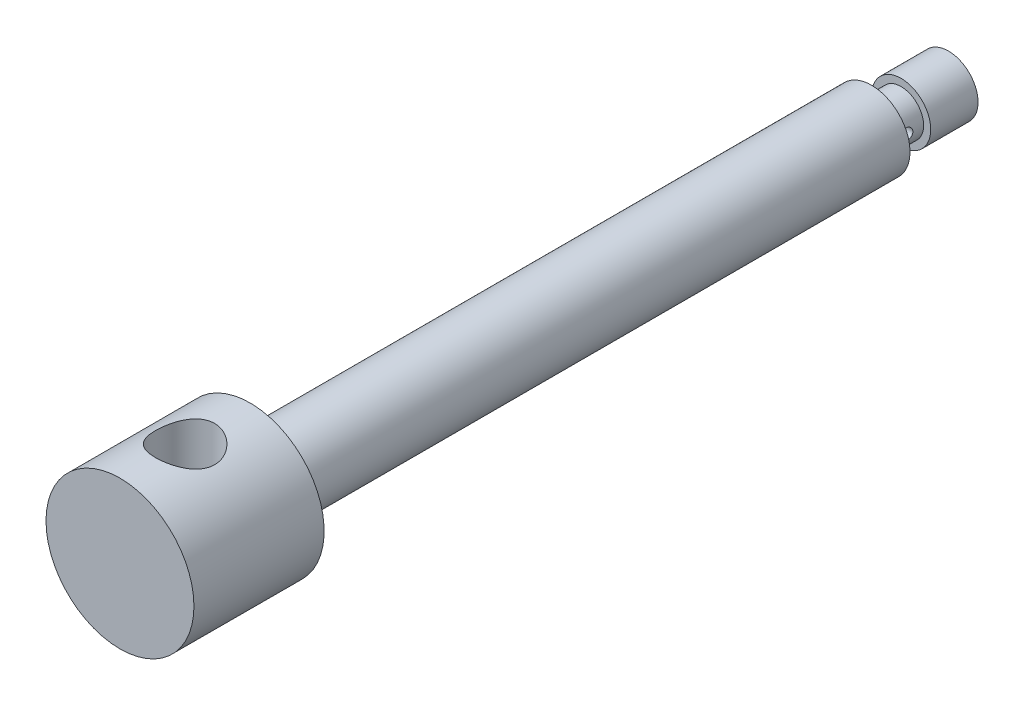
ISO-10303-21;
HEADER;
FILE_DESCRIPTION(('STEP AP214'),'2;1');
FILE_NAME('part.step','',(''),(''),'','','');
FILE_SCHEMA(('AUTOMOTIVE_DESIGN { 1 0 10303 214 1 1 1 1 }'));
ENDSEC;
DATA;
#1=APPLICATION_CONTEXT('core data for automotive mechanical design processes');
#2=APPLICATION_PROTOCOL_DEFINITION('international standard','automotive_design',2000,#1);
#3=PRODUCT_CONTEXT('',#1,'mechanical');
#4=PRODUCT('Part','Part','',(#3));
#5=PRODUCT_RELATED_PRODUCT_CATEGORY('part','',(#4));
#6=PRODUCT_DEFINITION_FORMATION('','',#4);
#7=PRODUCT_DEFINITION_CONTEXT('part definition',#1,'design');
#8=PRODUCT_DEFINITION('design','',#6,#7);
#9=PRODUCT_DEFINITION_SHAPE('','',#8);
#10=(LENGTH_UNIT() NAMED_UNIT(*) SI_UNIT(.MILLI.,.METRE.));
#11=(NAMED_UNIT(*) PLANE_ANGLE_UNIT() SI_UNIT($,.RADIAN.));
#12=(NAMED_UNIT(*) SI_UNIT($,.STERADIAN.) SOLID_ANGLE_UNIT());
#13=UNCERTAINTY_MEASURE_WITH_UNIT(LENGTH_MEASURE(1.E-05),#10,'distance_accuracy_value','');
#14=(GEOMETRIC_REPRESENTATION_CONTEXT(3) GLOBAL_UNCERTAINTY_ASSIGNED_CONTEXT((#13)) GLOBAL_UNIT_ASSIGNED_CONTEXT((#10,
#11,#12)) REPRESENTATION_CONTEXT('',''));
#15=CARTESIAN_POINT('',(0.,0.,0.));
#16=DIRECTION('',(0.,0.,1.));
#17=DIRECTION('',(1.,0.,0.));
#18=AXIS2_PLACEMENT_3D('',#15,#16,#17);
#19=CARTESIAN_POINT('',(0.,0.,140.));
#20=DIRECTION('',(0.,0.,-1.));
#21=DIRECTION('',(-1.,0.,0.));
#22=AXIS2_PLACEMENT_3D('',#19,#20,#21);
#23=CYLINDRICAL_SURFACE('',#22,12.5);
#24=CARTESIAN_POINT('',(0.,-12.5,134.));
#25=CARTESIAN_POINT('',(-0.134428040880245,-12.4999993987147,133.999999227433));
#26=CARTESIAN_POINT('',(-0.268907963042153,-12.4978254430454,133.994571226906));
#27=CARTESIAN_POINT('',(-0.536916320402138,-12.4891841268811,133.972908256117));
#28=CARTESIAN_POINT('',(-0.670444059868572,-12.482713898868,133.956666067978));
#29=CARTESIAN_POINT('',(-0.935792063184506,-12.4656328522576,133.913491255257));
#30=CARTESIAN_POINT('',(-1.06760803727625,-12.45501315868,133.886535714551));
#31=CARTESIAN_POINT('',(-1.32834211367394,-12.4299104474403,133.822193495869));
#32=CARTESIAN_POINT('',(-1.45725900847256,-12.4154258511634,133.78480255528));
#33=CARTESIAN_POINT('',(-1.71081101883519,-12.3830283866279,133.700097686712));
#34=CARTESIAN_POINT('',(-1.83546024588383,-12.3651284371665,133.652821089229));
#35=CARTESIAN_POINT('',(-2.08021423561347,-12.3263173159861,133.548672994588));
#36=CARTESIAN_POINT('',(-2.20031728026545,-12.3054050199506,133.491797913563));
#37=CARTESIAN_POINT('',(-2.5525365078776,-12.2389309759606,133.307506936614));
#38=CARTESIAN_POINT('',(-2.77691477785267,-12.1895849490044,133.166306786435));
#39=CARTESIAN_POINT('',(-3.20878788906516,-12.0832695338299,132.844405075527));
#40=CARTESIAN_POINT('',(-3.41514420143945,-12.0260638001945,132.662267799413));
#41=CARTESIAN_POINT('',(-3.79544899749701,-11.9115080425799,132.266465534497));
#42=CARTESIAN_POINT('',(-3.96938162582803,-11.8541579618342,132.052785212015));
#43=CARTESIAN_POINT('',(-4.20603567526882,-11.7714356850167,131.707393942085));
#44=CARTESIAN_POINT('',(-4.28222203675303,-11.7438622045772,131.585220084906));
#45=CARTESIAN_POINT('',(-4.42396507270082,-11.6912035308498,131.334363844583));
#46=CARTESIAN_POINT('',(-4.4895261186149,-11.6661173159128,131.205684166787));
#47=CARTESIAN_POINT('',(-4.60945924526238,-11.6192528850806,130.942624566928));
#48=CARTESIAN_POINT('',(-4.66383056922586,-11.5974748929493,130.808244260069));
#49=CARTESIAN_POINT('',(-4.76082403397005,-11.5579971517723,130.534791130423));
#50=CARTESIAN_POINT('',(-4.80345206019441,-11.5402953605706,130.39572069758));
#51=CARTESIAN_POINT('',(-4.87487504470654,-11.5103008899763,130.120233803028));
#52=CARTESIAN_POINT('',(-4.90420529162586,-11.4978009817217,129.983978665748));
#53=CARTESIAN_POINT('',(-4.95140857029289,-11.4775526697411,129.709206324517));
#54=CARTESIAN_POINT('',(-4.96928677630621,-11.4698021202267,129.570690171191));
#55=CARTESIAN_POINT('',(-4.99338985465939,-11.4593294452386,129.292486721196));
#56=CARTESIAN_POINT('',(-4.99961718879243,-11.4566062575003,129.152799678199));
#57=CARTESIAN_POINT('',(-5.0003485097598,-11.4562871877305,128.873392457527));
#58=CARTESIAN_POINT('',(-4.99485304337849,-11.4586910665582,128.7336722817));
#59=CARTESIAN_POINT('',(-4.97300139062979,-11.4681900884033,128.465095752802));
#60=CARTESIAN_POINT('',(-4.95743098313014,-11.4749456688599,128.33616251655));
#61=CARTESIAN_POINT('',(-4.91636669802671,-11.4925992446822,128.080133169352));
#62=CARTESIAN_POINT('',(-4.89086955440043,-11.5034986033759,127.953037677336));
#63=CARTESIAN_POINT('',(-4.83020381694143,-11.5291029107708,127.701598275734));
#64=CARTESIAN_POINT('',(-4.79503755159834,-11.5438069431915,127.577253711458));
#65=CARTESIAN_POINT('',(-4.71535272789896,-11.5765839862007,127.332038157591));
#66=CARTESIAN_POINT('',(-4.67083057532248,-11.5946582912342,127.211168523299));
#67=CARTESIAN_POINT('',(-4.52178156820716,-11.6539749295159,126.850100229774));
#68=CARTESIAN_POINT('',(-4.40296429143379,-11.6997808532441,126.616367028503));
#69=CARTESIAN_POINT('',(-4.13125151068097,-11.7984565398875,126.171420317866));
#70=CARTESIAN_POINT('',(-3.97834320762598,-11.851328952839,125.960215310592));
#71=CARTESIAN_POINT('',(-3.62889137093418,-11.9631659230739,125.548992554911));
#72=CARTESIAN_POINT('',(-3.42988845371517,-12.0222854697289,125.351101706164));
#73=CARTESIAN_POINT('',(-3.0007412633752,-12.1365017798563,124.990765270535));
#74=CARTESIAN_POINT('',(-2.77059080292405,-12.1915977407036,124.828326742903));
#75=CARTESIAN_POINT('',(-2.40397180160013,-12.2673153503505,124.613475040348));
#76=CARTESIAN_POINT('',(-2.2767950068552,-12.2916102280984,124.546127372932));
#77=CARTESIAN_POINT('',(-2.01664956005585,-12.3369572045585,124.422464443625));
#78=CARTESIAN_POINT('',(-1.88368330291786,-12.3580106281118,124.366144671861));
#79=CARTESIAN_POINT('',(-1.61291597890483,-12.3962575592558,124.265088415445));
#80=CARTESIAN_POINT('',(-1.47511586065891,-12.4134518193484,124.220349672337));
#81=CARTESIAN_POINT('',(-1.19570710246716,-12.4434728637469,124.142913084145));
#82=CARTESIAN_POINT('',(-1.05409872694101,-12.4562999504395,124.110214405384));
#83=CARTESIAN_POINT('',(-0.776729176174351,-12.4765727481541,124.058806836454));
#84=CARTESIAN_POINT('',(-0.641120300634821,-12.4842928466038,124.039382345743));
#85=CARTESIAN_POINT('',(-0.368536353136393,-12.4953107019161,124.011718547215));
#86=CARTESIAN_POINT('',(-0.231560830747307,-12.4986069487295,124.00348305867));
#87=CARTESIAN_POINT('',(0.0425534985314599,-12.5006785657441,123.998303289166));
#88=CARTESIAN_POINT('',(0.179692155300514,-12.4994566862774,124.001352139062));
#89=CARTESIAN_POINT('',(0.453193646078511,-12.4925311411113,124.018695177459));
#90=CARTESIAN_POINT('',(0.589556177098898,-12.4868258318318,124.032993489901));
#91=CARTESIAN_POINT('',(0.8542487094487,-12.4714486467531,124.071782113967));
#92=CARTESIAN_POINT('',(0.982662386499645,-12.4619685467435,124.095780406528));
#93=CARTESIAN_POINT('',(1.236951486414,-12.4393027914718,124.153665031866));
#94=CARTESIAN_POINT('',(1.36282600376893,-12.4261158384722,124.187554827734));
#95=CARTESIAN_POINT('',(1.61115102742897,-12.396363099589,124.26490828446));
#96=CARTESIAN_POINT('',(1.73360251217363,-12.3797982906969,124.308369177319));
#97=CARTESIAN_POINT('',(1.97439656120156,-12.3436873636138,124.404503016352));
#98=CARTESIAN_POINT('',(2.0927375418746,-12.324140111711,124.457179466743));
#99=CARTESIAN_POINT('',(2.44755555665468,-12.2604306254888,124.631907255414));
#100=CARTESIAN_POINT('',(2.67640599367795,-12.2121249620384,124.768346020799));
#101=CARTESIAN_POINT('',(3.10864805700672,-12.1093295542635,125.074868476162));
#102=CARTESIAN_POINT('',(3.31202942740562,-12.0548373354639,125.244965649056));
#103=CARTESIAN_POINT('',(3.7017918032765,-11.941130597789,125.627158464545));
#104=CARTESIAN_POINT('',(3.88616393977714,-11.8818418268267,125.841285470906));
#105=CARTESIAN_POINT('',(4.21689889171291,-11.7685360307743,126.29864859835));
#106=CARTESIAN_POINT('',(4.36325544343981,-11.7145198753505,126.541889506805));
#107=CARTESIAN_POINT('',(4.55142555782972,-11.6421255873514,126.925118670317));
#108=CARTESIAN_POINT('',(4.60914530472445,-11.6193337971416,127.05667972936));
#109=CARTESIAN_POINT('',(4.7132051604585,-11.5775147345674,127.324787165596));
#110=CARTESIAN_POINT('',(4.7595502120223,-11.5584858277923,127.461331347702));
#111=CARTESIAN_POINT('',(4.84036067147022,-11.5248785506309,127.73836312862));
#112=CARTESIAN_POINT('',(4.87483074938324,-11.5102984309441,127.878849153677));
#113=CARTESIAN_POINT('',(4.93151664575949,-11.4861263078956,128.162694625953));
#114=CARTESIAN_POINT('',(4.95373349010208,-11.4765338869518,128.306053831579));
#115=CARTESIAN_POINT('',(4.9844819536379,-11.463210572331,128.583998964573));
#116=CARTESIAN_POINT('',(4.99388565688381,-11.4591065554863,128.718471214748));
#117=CARTESIAN_POINT('',(5.00180093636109,-11.4556539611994,128.987846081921));
#118=CARTESIAN_POINT('',(5.00030885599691,-11.4563069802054,129.122748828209));
#119=CARTESIAN_POINT('',(4.98644346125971,-11.4623486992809,129.391817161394));
#120=CARTESIAN_POINT('',(4.97407559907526,-11.4677350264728,129.525983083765));
#121=CARTESIAN_POINT('',(4.93860056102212,-11.4830569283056,129.792672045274));
#122=CARTESIAN_POINT('',(4.91548933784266,-11.4929942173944,129.92519444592));
#123=CARTESIAN_POINT('',(4.8599068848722,-11.5166044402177,130.182329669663));
#124=CARTESIAN_POINT('',(4.82784722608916,-11.5301119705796,130.307046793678));
#125=CARTESIAN_POINT('',(4.75435551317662,-11.5606089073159,130.553266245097));
#126=CARTESIAN_POINT('',(4.71292020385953,-11.5775995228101,130.674767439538));
#127=CARTESIAN_POINT('',(4.57505004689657,-11.6330901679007,131.033314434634));
#128=CARTESIAN_POINT('',(4.46501084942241,-11.6761269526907,131.264587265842));
#129=CARTESIAN_POINT('',(4.20467910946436,-11.7724663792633,131.719056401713));
#130=CARTESIAN_POINT('',(4.052442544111,-11.8262157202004,131.941032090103));
#131=CARTESIAN_POINT('',(3.71470108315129,-11.9366014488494,132.357497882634));
#132=CARTESIAN_POINT('',(3.52918616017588,-11.9932387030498,132.551979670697));
#133=CARTESIAN_POINT('',(3.22271513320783,-12.0779292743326,132.825513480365));
#134=CARTESIAN_POINT('',(3.11206947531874,-12.1069791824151,132.916056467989));
#135=CARTESIAN_POINT('',(2.88318647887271,-12.1635153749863,133.08749937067));
#136=CARTESIAN_POINT('',(2.76495189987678,-12.1910022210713,133.16840276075));
#137=CARTESIAN_POINT('',(2.52148785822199,-12.2436771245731,133.32003376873));
#138=CARTESIAN_POINT('',(2.39625194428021,-12.268863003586,133.390751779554));
#139=CARTESIAN_POINT('',(2.13974317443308,-12.3161883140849,133.52130456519));
#140=CARTESIAN_POINT('',(2.00847311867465,-12.338329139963,133.581144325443));
#141=CARTESIAN_POINT('',(1.7431850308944,-12.378569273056,133.688433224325));
#142=CARTESIAN_POINT('',(1.60925996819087,-12.3967345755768,133.736087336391));
#143=CARTESIAN_POINT('',(1.33744351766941,-12.4289968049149,133.819902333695));
#144=CARTESIAN_POINT('',(1.19955402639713,-12.4430956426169,133.856068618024));
#145=CARTESIAN_POINT('',(0.921178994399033,-12.4667917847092,133.916469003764));
#146=CARTESIAN_POINT('',(0.780700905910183,-12.4764003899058,133.94073306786));
#147=CARTESIAN_POINT('',(0.498015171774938,-12.4908758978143,133.977174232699));
#148=CARTESIAN_POINT('',(0.35580891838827,-12.4957463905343,133.989360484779));
#149=CARTESIAN_POINT('',(0.177825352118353,-12.4987857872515,133.996963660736));
#150=CARTESIAN_POINT('',(0.142272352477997,-12.4992409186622,133.998102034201));
#151=CARTESIAN_POINT('',(0.0711474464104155,-12.4998481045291,133.999620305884));
#152=CARTESIAN_POINT('',(0.0355755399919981,-12.5000001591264,134.000000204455));
#153=CARTESIAN_POINT('',(0.,-12.5,134.));
#154=B_SPLINE_CURVE_WITH_KNOTS('',3,(#24,#25,#26,#27,#28,#29,#30,#31,#32,#33,#34,#35,#36,#37,
#38,#39,#40,#41,#42,#43,#44,#45,#46,#47,#48,#49,#50,#51,#52,#53,#54,#55,#56,#57,#58,#59,#60,#61,
#62,#63,#64,#65,#66,#67,#68,#69,#70,#71,#72,#73,#74,#75,#76,#77,#78,#79,#80,#81,#82,#83,#84,#85,
#86,#87,#88,#89,#90,#91,#92,#93,#94,#95,#96,#97,#98,#99,#100,#101,#102,#103,#104,#105,#106,#107,
#108,#109,#110,#111,#112,#113,#114,#115,#116,#117,#118,#119,#120,#121,#122,#123,#124,#125,#126,
#127,#128,#129,#130,#131,#132,#133,#134,#135,#136,#137,#138,#139,#140,#141,#142,#143,#144,#145,
#146,#147,#148,#149,#150,#151,#152,#153),.UNSPECIFIED.,.T.,.F.,(4,2,2,2,2,2,2,2,2,2,2,2,2,2,2,2,
2,2,2,2,2,2,2,2,2,2,2,2,2,2,2,2,2,2,2,2,2,2,2,2,2,2,2,2,2,2,2,2,2,2,2,2,2,2,2,2,2,2,2,2,2,2,2,2,
4),(0.,0.403247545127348,0.806764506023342,1.21114928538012,1.61569948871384,2.01874874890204,
2.42194883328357,3.22723902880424,4.06710473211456,4.90738006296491,5.3467199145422,
5.78587855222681,6.22506688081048,6.66403469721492,7.08328748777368,7.50235071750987,
7.92132539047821,8.34028052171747,8.72995920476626,9.119766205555,9.50947941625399,
9.89934261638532,10.6941760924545,11.4893084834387,12.3459066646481,13.2026752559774,
13.6400384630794,14.0772224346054,14.5143210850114,14.9513894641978,15.3624968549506,
15.7737445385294,16.1847419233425,16.5958900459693,16.9883780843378,17.3810037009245,
17.7735159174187,18.1661777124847,18.9747143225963,19.783575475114,20.6458383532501,
21.5082432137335,21.9441519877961,22.379871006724,22.8154184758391,23.2509294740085,
23.655003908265,24.0592139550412,24.4632214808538,24.8673813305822,25.2553678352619,
25.6434892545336,26.4191721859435,27.2392679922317,28.0596113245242,28.4968494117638,
28.9339293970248,29.3714189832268,29.8087075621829,30.2380680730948,30.667226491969,
31.0952989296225,31.5230467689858,31.6297637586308,31.7364806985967),.UNSPECIFIED.);
#155=CARTESIAN_POINT('',(0.,-12.5,134.));
#156=VERTEX_POINT('',#155);
#157=EDGE_CURVE('E94',#156,#156,#154,.T.);
#158=ORIENTED_EDGE('',*,*,#157,.F.);
#159=EDGE_LOOP('',(#158));
#160=FACE_BOUND('',#159,.T.);
#161=CARTESIAN_POINT('',(0.,12.5,124.));
#162=CARTESIAN_POINT('',(0.134428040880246,12.4999993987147,124.000000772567));
#163=CARTESIAN_POINT('',(0.268907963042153,12.4978254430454,124.005428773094));
#164=CARTESIAN_POINT('',(0.536916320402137,12.4891841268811,124.027091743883));
#165=CARTESIAN_POINT('',(0.67044405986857,12.482713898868,124.043333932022));
#166=CARTESIAN_POINT('',(0.935792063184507,12.4656328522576,124.086508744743));
#167=CARTESIAN_POINT('',(1.06760803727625,12.45501315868,124.113464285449));
#168=CARTESIAN_POINT('',(1.32834211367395,12.4299104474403,124.177806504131));
#169=CARTESIAN_POINT('',(1.45725900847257,12.4154258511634,124.21519744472));
#170=CARTESIAN_POINT('',(1.71081101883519,12.3830283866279,124.299902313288));
#171=CARTESIAN_POINT('',(1.83546024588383,12.3651284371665,124.347178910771));
#172=CARTESIAN_POINT('',(2.08021423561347,12.3263173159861,124.451327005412));
#173=CARTESIAN_POINT('',(2.20031728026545,12.3054050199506,124.508202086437));
#174=CARTESIAN_POINT('',(2.5525365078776,12.2389309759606,124.692493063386));
#175=CARTESIAN_POINT('',(2.77691477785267,12.1895849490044,124.833693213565));
#176=CARTESIAN_POINT('',(3.20878788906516,12.0832695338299,125.155594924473));
#177=CARTESIAN_POINT('',(3.41514420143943,12.0260638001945,125.337732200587));
#178=CARTESIAN_POINT('',(3.79544899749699,11.9115080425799,125.733534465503));
#179=CARTESIAN_POINT('',(3.96938162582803,11.8541579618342,125.947214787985));
#180=CARTESIAN_POINT('',(4.20603567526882,11.7714356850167,126.292606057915));
#181=CARTESIAN_POINT('',(4.28222203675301,11.7438622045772,126.414779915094));
#182=CARTESIAN_POINT('',(4.42396507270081,11.6912035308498,126.665636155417));
#183=CARTESIAN_POINT('',(4.4895261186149,11.6661173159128,126.794315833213));
#184=CARTESIAN_POINT('',(4.60945924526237,11.6192528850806,127.057375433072));
#185=CARTESIAN_POINT('',(4.66383056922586,11.5974748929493,127.191755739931));
#186=CARTESIAN_POINT('',(4.76082403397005,11.5579971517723,127.465208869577));
#187=CARTESIAN_POINT('',(4.80345206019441,11.5402953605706,127.60427930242));
#188=CARTESIAN_POINT('',(4.87487504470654,11.5103008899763,127.879766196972));
#189=CARTESIAN_POINT('',(4.90420529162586,11.4978009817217,128.016021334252));
#190=CARTESIAN_POINT('',(4.95140857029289,11.4775526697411,128.290793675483));
#191=CARTESIAN_POINT('',(4.9692867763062,11.4698021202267,128.429309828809));
#192=CARTESIAN_POINT('',(4.99338985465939,11.4593294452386,128.707513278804));
#193=CARTESIAN_POINT('',(4.99961718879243,11.4566062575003,128.847200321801));
#194=CARTESIAN_POINT('',(5.0003485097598,11.4562871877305,129.126607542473));
#195=CARTESIAN_POINT('',(4.99485304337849,11.4586910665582,129.2663277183));
#196=CARTESIAN_POINT('',(4.97300139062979,11.4681900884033,129.534904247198));
#197=CARTESIAN_POINT('',(4.95743098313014,11.4749456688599,129.66383748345));
#198=CARTESIAN_POINT('',(4.91636669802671,11.4925992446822,129.919866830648));
#199=CARTESIAN_POINT('',(4.89086955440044,11.5034986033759,130.046962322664));
#200=CARTESIAN_POINT('',(4.83020381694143,11.5291029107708,130.298401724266));
#201=CARTESIAN_POINT('',(4.79503755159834,11.5438069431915,130.422746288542));
#202=CARTESIAN_POINT('',(4.71535272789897,11.5765839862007,130.667961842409));
#203=CARTESIAN_POINT('',(4.67083057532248,11.5946582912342,130.788831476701));
#204=CARTESIAN_POINT('',(4.52178156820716,11.6539749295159,131.149899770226));
#205=CARTESIAN_POINT('',(4.40296429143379,11.6997808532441,131.383632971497));
#206=CARTESIAN_POINT('',(4.13125151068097,11.7984565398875,131.828579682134));
#207=CARTESIAN_POINT('',(3.97834320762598,11.851328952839,132.039784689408));
#208=CARTESIAN_POINT('',(3.62889137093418,11.9631659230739,132.451007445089));
#209=CARTESIAN_POINT('',(3.42988845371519,12.0222854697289,132.648898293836));
#210=CARTESIAN_POINT('',(3.00074126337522,12.1365017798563,133.009234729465));
#211=CARTESIAN_POINT('',(2.77059080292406,12.1915977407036,133.171673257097));
#212=CARTESIAN_POINT('',(2.40397180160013,12.2673153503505,133.386524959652));
#213=CARTESIAN_POINT('',(2.2767950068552,12.2916102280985,133.453872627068));
#214=CARTESIAN_POINT('',(2.01664956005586,12.3369572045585,133.577535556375));
#215=CARTESIAN_POINT('',(1.88368330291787,12.3580106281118,133.633855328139));
#216=CARTESIAN_POINT('',(1.61291597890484,12.3962575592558,133.734911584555));
#217=CARTESIAN_POINT('',(1.47511586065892,12.4134518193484,133.779650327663));
#218=CARTESIAN_POINT('',(1.19570710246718,12.4434728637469,133.857086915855));
#219=CARTESIAN_POINT('',(1.05409872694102,12.4562999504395,133.889785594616));
#220=CARTESIAN_POINT('',(0.776729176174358,12.4765727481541,133.941193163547));
#221=CARTESIAN_POINT('',(0.641120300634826,12.4842928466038,133.960617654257));
#222=CARTESIAN_POINT('',(0.368536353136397,12.4953107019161,133.988281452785));
#223=CARTESIAN_POINT('',(0.231560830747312,12.4986069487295,133.996516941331));
#224=CARTESIAN_POINT('',(-0.0425534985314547,12.5006785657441,134.001696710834));
#225=CARTESIAN_POINT('',(-0.17969215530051,12.4994566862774,133.998647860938));
#226=CARTESIAN_POINT('',(-0.453193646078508,12.4925311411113,133.981304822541));
#227=CARTESIAN_POINT('',(-0.589556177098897,12.4868258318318,133.967006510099));
#228=CARTESIAN_POINT('',(-0.854248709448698,12.4714486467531,133.928217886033));
#229=CARTESIAN_POINT('',(-0.982662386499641,12.4619685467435,133.904219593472));
#230=CARTESIAN_POINT('',(-1.236951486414,12.4393027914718,133.846334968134));
#231=CARTESIAN_POINT('',(-1.36282600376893,12.4261158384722,133.812445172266));
#232=CARTESIAN_POINT('',(-1.61115102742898,12.396363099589,133.73509171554));
#233=CARTESIAN_POINT('',(-1.73360251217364,12.3797982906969,133.691630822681));
#234=CARTESIAN_POINT('',(-1.97439656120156,12.3436873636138,133.595496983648));
#235=CARTESIAN_POINT('',(-2.0927375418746,12.324140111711,133.542820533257));
#236=CARTESIAN_POINT('',(-2.44755555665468,12.2604306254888,133.368092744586));
#237=CARTESIAN_POINT('',(-2.67640599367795,12.2121249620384,133.231653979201));
#238=CARTESIAN_POINT('',(-3.10864805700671,12.1093295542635,132.925131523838));
#239=CARTESIAN_POINT('',(-3.31202942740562,12.0548373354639,132.755034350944));
#240=CARTESIAN_POINT('',(-3.7017918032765,11.941130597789,132.372841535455));
#241=CARTESIAN_POINT('',(-3.88616393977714,11.8818418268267,132.158714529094));
#242=CARTESIAN_POINT('',(-4.21689889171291,11.7685360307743,131.70135140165));
#243=CARTESIAN_POINT('',(-4.36325544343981,11.7145198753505,131.458110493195));
#244=CARTESIAN_POINT('',(-4.55142555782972,11.6421255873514,131.074881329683));
#245=CARTESIAN_POINT('',(-4.60914530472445,11.6193337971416,130.94332027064));
#246=CARTESIAN_POINT('',(-4.7132051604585,11.5775147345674,130.675212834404));
#247=CARTESIAN_POINT('',(-4.7595502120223,11.5584858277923,130.538668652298));
#248=CARTESIAN_POINT('',(-4.84036067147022,11.5248785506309,130.26163687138));
#249=CARTESIAN_POINT('',(-4.87483074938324,11.5102984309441,130.121150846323));
#250=CARTESIAN_POINT('',(-4.93151664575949,11.4861263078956,129.837305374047));
#251=CARTESIAN_POINT('',(-4.95373349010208,11.4765338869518,129.693946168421));
#252=CARTESIAN_POINT('',(-4.9844819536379,11.463210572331,129.416001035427));
#253=CARTESIAN_POINT('',(-4.99388565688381,11.4591065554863,129.281528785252));
#254=CARTESIAN_POINT('',(-5.00180093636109,11.4556539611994,129.012153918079));
#255=CARTESIAN_POINT('',(-5.00030885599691,11.4563069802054,128.877251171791));
#256=CARTESIAN_POINT('',(-4.98644346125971,11.4623486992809,128.608182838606));
#257=CARTESIAN_POINT('',(-4.97407559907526,11.4677350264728,128.474016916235));
#258=CARTESIAN_POINT('',(-4.93860056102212,11.4830569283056,128.207327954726));
#259=CARTESIAN_POINT('',(-4.91548933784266,11.4929942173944,128.07480555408));
#260=CARTESIAN_POINT('',(-4.85990688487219,11.5166044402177,127.817670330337));
#261=CARTESIAN_POINT('',(-4.82784722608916,11.5301119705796,127.692953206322));
#262=CARTESIAN_POINT('',(-4.75435551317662,11.5606089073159,127.446733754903));
#263=CARTESIAN_POINT('',(-4.71292020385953,11.5775995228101,127.325232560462));
#264=CARTESIAN_POINT('',(-4.57505004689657,11.6330901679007,126.966685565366));
#265=CARTESIAN_POINT('',(-4.46501084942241,11.6761269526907,126.735412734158));
#266=CARTESIAN_POINT('',(-4.20467910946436,11.7724663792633,126.280943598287));
#267=CARTESIAN_POINT('',(-4.052442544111,11.8262157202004,126.058967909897));
#268=CARTESIAN_POINT('',(-3.71470108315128,11.9366014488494,125.642502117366));
#269=CARTESIAN_POINT('',(-3.52918616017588,11.9932387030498,125.448020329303));
#270=CARTESIAN_POINT('',(-3.22271513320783,12.0779292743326,125.174486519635));
#271=CARTESIAN_POINT('',(-3.11206947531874,12.1069791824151,125.083943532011));
#272=CARTESIAN_POINT('',(-2.88318647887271,12.1635153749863,124.91250062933));
#273=CARTESIAN_POINT('',(-2.76495189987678,12.1910022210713,124.83159723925));
#274=CARTESIAN_POINT('',(-2.521487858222,12.2436771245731,124.67996623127));
#275=CARTESIAN_POINT('',(-2.39625194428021,12.268863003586,124.609248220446));
#276=CARTESIAN_POINT('',(-2.13974317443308,12.3161883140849,124.47869543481));
#277=CARTESIAN_POINT('',(-2.00847311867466,12.338329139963,124.418855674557));
#278=CARTESIAN_POINT('',(-1.74318503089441,12.378569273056,124.311566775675));
#279=CARTESIAN_POINT('',(-1.60925996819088,12.3967345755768,124.263912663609));
#280=CARTESIAN_POINT('',(-1.33744351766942,12.4289968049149,124.180097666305));
#281=CARTESIAN_POINT('',(-1.19955402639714,12.4430956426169,124.143931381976));
#282=CARTESIAN_POINT('',(-0.921178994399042,12.4667917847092,124.083530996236));
#283=CARTESIAN_POINT('',(-0.780700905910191,12.4764003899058,124.05926693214));
#284=CARTESIAN_POINT('',(-0.498015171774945,12.4908758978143,124.022825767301));
#285=CARTESIAN_POINT('',(-0.355808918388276,12.4957463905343,124.010639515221));
#286=CARTESIAN_POINT('',(-0.177825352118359,12.4987857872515,124.003036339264));
#287=CARTESIAN_POINT('',(-0.142272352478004,12.4992409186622,124.001897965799));
#288=CARTESIAN_POINT('',(-0.07114744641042,12.4998481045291,124.000379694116));
#289=CARTESIAN_POINT('',(-0.0355755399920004,12.5000001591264,123.999999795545));
#290=CARTESIAN_POINT('',(0.,12.5,124.));
#291=B_SPLINE_CURVE_WITH_KNOTS('',3,(#161,#162,#163,#164,#165,#166,#167,#168,#169,#170,#171,
#172,#173,#174,#175,#176,#177,#178,#179,#180,#181,#182,#183,#184,#185,#186,#187,#188,#189,#190,
#191,#192,#193,#194,#195,#196,#197,#198,#199,#200,#201,#202,#203,#204,#205,#206,#207,#208,#209,
#210,#211,#212,#213,#214,#215,#216,#217,#218,#219,#220,#221,#222,#223,#224,#225,#226,#227,#228,
#229,#230,#231,#232,#233,#234,#235,#236,#237,#238,#239,#240,#241,#242,#243,#244,#245,#246,#247,
#248,#249,#250,#251,#252,#253,#254,#255,#256,#257,#258,#259,#260,#261,#262,#263,#264,#265,#266,
#267,#268,#269,#270,#271,#272,#273,#274,#275,#276,#277,#278,#279,#280,#281,#282,#283,#284,#285,
#286,#287,#288,#289,#290),.UNSPECIFIED.,.T.,.F.,(4,2,2,2,2,2,2,2,2,2,2,2,2,2,2,2,2,2,2,2,2,2,2,
2,2,2,2,2,2,2,2,2,2,2,2,2,2,2,2,2,2,2,2,2,2,2,2,2,2,2,2,2,2,2,2,2,2,2,2,2,2,2,2,2,4),(0.,
0.403247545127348,0.806764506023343,1.21114928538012,1.61569948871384,2.01874874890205,
2.42194883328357,3.22723902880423,4.06710473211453,4.90738006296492,5.34671991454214,
5.78587855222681,6.22506688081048,6.66403469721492,7.08328748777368,7.50235071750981,
7.92132539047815,8.34028052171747,8.72995920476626,9.119766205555,9.50947941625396,
9.89934261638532,10.6941760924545,11.4893084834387,12.345906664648,13.2026752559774,
13.6400384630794,14.0772224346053,14.5143210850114,14.9513894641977,15.3624968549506,
15.7737445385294,16.1847419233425,16.5958900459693,16.9883780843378,17.3810037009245,
17.7735159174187,18.1661777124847,18.9747143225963,19.783575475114,20.6458383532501,
21.5082432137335,21.9441519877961,22.379871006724,22.815418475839,23.2509294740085,
23.655003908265,24.0592139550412,24.4632214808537,24.8673813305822,25.2553678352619,
25.6434892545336,26.4191721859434,27.2392679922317,28.0596113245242,28.4968494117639,
28.9339293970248,29.3714189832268,29.8087075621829,30.2380680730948,30.667226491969,
31.0952989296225,31.5230467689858,31.6297637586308,31.7364806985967),.UNSPECIFIED.);
#292=CARTESIAN_POINT('',(0.,12.5,124.));
#293=VERTEX_POINT('',#292);
#294=EDGE_CURVE('E87',#293,#293,#291,.T.);
#295=ORIENTED_EDGE('',*,*,#294,.T.);
#296=EDGE_LOOP('',(#295));
#297=FACE_BOUND('',#296,.T.);
#298=CARTESIAN_POINT('',(0.,0.,140.));
#299=DIRECTION('',(0.,0.,1.));
#300=DIRECTION('',(1.,0.,0.));
#301=AXIS2_PLACEMENT_3D('',#298,#299,#300);
#302=CIRCLE('',#301,12.5);
#303=CARTESIAN_POINT('',(12.5,0.,140.));
#304=VERTEX_POINT('',#303);
#305=EDGE_CURVE('E10',#304,#304,#302,.T.);
#306=ORIENTED_EDGE('',*,*,#305,.F.);
#307=EDGE_LOOP('',(#306));
#308=FACE_BOUND('',#307,.T.);
#309=CARTESIAN_POINT('',(0.,0.,118.));
#310=DIRECTION('',(0.,0.,-1.));
#311=DIRECTION('',(-1.,0.,0.));
#312=AXIS2_PLACEMENT_3D('',#309,#310,#311);
#313=CIRCLE('',#312,12.5);
#314=CARTESIAN_POINT('',(-12.5,0.,118.));
#315=VERTEX_POINT('',#314);
#316=EDGE_CURVE('E54',#315,#315,#313,.T.);
#317=ORIENTED_EDGE('',*,*,#316,.F.);
#318=EDGE_LOOP('',(#317));
#319=FACE_BOUND('',#318,.T.);
#320=ADVANCED_FACE('F41',(#160,#297,#308,#319),#23,.T.);
#321=CARTESIAN_POINT('',(0.,0.,140.));
#322=DIRECTION('',(0.,0.,1.));
#323=DIRECTION('',(1.,0.,0.));
#324=AXIS2_PLACEMENT_3D('',#321,#322,#323);
#325=PLANE('',#324);
#326=ORIENTED_EDGE('',*,*,#305,.T.);
#327=EDGE_LOOP('',(#326));
#328=FACE_BOUND('',#327,.T.);
#329=ADVANCED_FACE('F111',(#328),#325,.T.);
#330=CARTESIAN_POINT('',(3.80000000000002,0.,118.));
#331=DIRECTION('',(0.,0.,-1.));
#332=DIRECTION('',(-1.,0.,0.));
#333=AXIS2_PLACEMENT_3D('',#330,#331,#332);
#334=PLANE('',#333);
#335=CARTESIAN_POINT('',(0.,0.,118.));
#336=DIRECTION('',(0.,0.,-1.));
#337=DIRECTION('',(-1.,0.,0.));
#338=AXIS2_PLACEMENT_3D('',#335,#336,#337);
#339=CIRCLE('',#338,3.80000000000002);
#340=CARTESIAN_POINT('',(-3.80000000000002,0.,118.));
#341=VERTEX_POINT('',#340);
#342=EDGE_CURVE('E102',#341,#341,#339,.T.);
#343=ORIENTED_EDGE('',*,*,#342,.F.);
#344=EDGE_LOOP('',(#343));
#345=FACE_BOUND('',#344,.T.);
#346=ORIENTED_EDGE('',*,*,#316,.T.);
#347=EDGE_LOOP('',(#346));
#348=FACE_BOUND('',#347,.T.);
#349=ADVANCED_FACE('F107',(#345,#348),#334,.T.);
#350=CARTESIAN_POINT('',(0.,0.,0.));
#351=DIRECTION('',(0.,0.,-1.));
#352=DIRECTION('',(-1.,0.,0.));
#353=AXIS2_PLACEMENT_3D('',#350,#351,#352);
#354=CYLINDRICAL_SURFACE('',#353,5.);
#355=CARTESIAN_POINT('',(0.,0.,8.));
#356=DIRECTION('',(0.,0.,-1.));
#357=DIRECTION('',(-1.,0.,0.));
#358=AXIS2_PLACEMENT_3D('',#355,#356,#357);
#359=CIRCLE('',#358,5.);
#360=CARTESIAN_POINT('',(-5.,0.,8.));
#361=VERTEX_POINT('',#360);
#362=EDGE_CURVE('E171',#361,#361,#359,.T.);
#363=ORIENTED_EDGE('',*,*,#362,.T.);
#364=EDGE_LOOP('',(#363));
#365=FACE_BOUND('',#364,.T.);
#366=CARTESIAN_POINT('',(0.,0.,0.));
#367=DIRECTION('',(0.,0.,-1.));
#368=DIRECTION('',(-1.,0.,0.));
#369=AXIS2_PLACEMENT_3D('',#366,#367,#368);
#370=CIRCLE('',#369,5.);
#371=CARTESIAN_POINT('',(-5.,0.,0.));
#372=VERTEX_POINT('',#371);
#373=EDGE_CURVE('E61',#372,#372,#370,.T.);
#374=ORIENTED_EDGE('',*,*,#373,.F.);
#375=EDGE_LOOP('',(#374));
#376=FACE_BOUND('',#375,.T.);
#377=ADVANCED_FACE('F110',(#365,#376),#354,.T.);
#378=CARTESIAN_POINT('',(5.,0.,8.));
#379=DIRECTION('',(0.,0.,1.));
#380=DIRECTION('',(1.,0.,0.));
#381=AXIS2_PLACEMENT_3D('',#378,#379,#380);
#382=PLANE('',#381);
#383=CARTESIAN_POINT('',(0.,0.,8.));
#384=DIRECTION('',(0.,0.,-1.));
#385=DIRECTION('',(-1.,0.,0.));
#386=AXIS2_PLACEMENT_3D('',#383,#384,#385);
#387=CIRCLE('',#386,3.8);
#388=CARTESIAN_POINT('',(-3.8,0.,8.));
#389=VERTEX_POINT('',#388);
#390=EDGE_CURVE('E168',#389,#389,#387,.T.);
#391=ORIENTED_EDGE('',*,*,#390,.T.);
#392=EDGE_LOOP('',(#391));
#393=FACE_BOUND('',#392,.T.);
#394=ORIENTED_EDGE('',*,*,#362,.F.);
#395=EDGE_LOOP('',(#394));
#396=FACE_BOUND('',#395,.T.);
#397=ADVANCED_FACE('F132',(#393,#396),#382,.T.);
#398=CARTESIAN_POINT('',(0.,0.,0.));
#399=DIRECTION('',(0.,0.,-1.));
#400=DIRECTION('',(-1.,0.,0.));
#401=AXIS2_PLACEMENT_3D('',#398,#399,#400);
#402=CYLINDRICAL_SURFACE('',#401,3.8);
#403=CARTESIAN_POINT('',(-3.8,0.,11.81));
#404=CARTESIAN_POINT('',(-3.79999914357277,0.0551538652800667,11.8099986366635));
#405=CARTESIAN_POINT('',(-3.79878738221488,0.110322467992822,11.8054217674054));
#406=CARTESIAN_POINT('',(-3.79407105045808,0.219072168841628,11.7872665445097));
#407=CARTESIAN_POINT('',(-3.79056533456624,0.272652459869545,11.7736836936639));
#408=CARTESIAN_POINT('',(-3.78164830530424,0.37663991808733,11.7379873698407));
#409=CARTESIAN_POINT('',(-3.77623941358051,0.42705102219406,11.7158847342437));
#410=CARTESIAN_POINT('',(-3.76408860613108,0.523450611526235,11.6638159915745));
#411=CARTESIAN_POINT('',(-3.75734661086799,0.569438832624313,11.6338494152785));
#412=CARTESIAN_POINT('',(-3.74308776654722,0.656727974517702,11.5661873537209));
#413=CARTESIAN_POINT('',(-3.73555794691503,0.697914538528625,11.5283470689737));
#414=CARTESIAN_POINT('',(-3.72065601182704,0.773436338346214,11.4463213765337));
#415=CARTESIAN_POINT('',(-3.71328391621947,0.807770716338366,11.4021351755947));
#416=CARTESIAN_POINT('',(-3.69939986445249,0.869166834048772,11.3077644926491));
#417=CARTESIAN_POINT('',(-3.69290429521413,0.896097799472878,11.257492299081));
#418=CARTESIAN_POINT('',(-3.68169912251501,0.941080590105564,11.1529351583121));
#419=CARTESIAN_POINT('',(-3.67698919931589,0.959134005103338,11.0986509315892));
#420=CARTESIAN_POINT('',(-3.67002237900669,0.985453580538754,10.9888752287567));
#421=CARTESIAN_POINT('',(-3.66771369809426,0.99392671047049,10.9334367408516));
#422=CARTESIAN_POINT('',(-3.66565598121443,1.00149032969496,10.8218807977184));
#423=CARTESIAN_POINT('',(-3.66590648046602,1.00058252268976,10.765763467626));
#424=CARTESIAN_POINT('',(-3.66889243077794,0.989574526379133,10.6560519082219));
#425=CARTESIAN_POINT('',(-3.67156040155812,0.979723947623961,10.6024305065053));
#426=CARTESIAN_POINT('',(-3.67897274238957,0.951509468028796,10.4976295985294));
#427=CARTESIAN_POINT('',(-3.68371727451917,0.933144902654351,10.446450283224));
#428=CARTESIAN_POINT('',(-3.69480804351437,0.888218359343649,10.3473316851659));
#429=CARTESIAN_POINT('',(-3.70117136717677,0.86156821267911,10.2994343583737));
#430=CARTESIAN_POINT('',(-3.71477344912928,0.800888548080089,10.208703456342));
#431=CARTESIAN_POINT('',(-3.72201237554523,0.766857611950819,10.1658708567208));
#432=CARTESIAN_POINT('',(-3.73683160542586,0.691102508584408,10.0850582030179));
#433=CARTESIAN_POINT('',(-3.74441545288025,0.64916850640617,10.0472752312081));
#434=CARTESIAN_POINT('',(-3.75886380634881,0.559467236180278,9.97923813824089));
#435=CARTESIAN_POINT('',(-3.76572828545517,0.511699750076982,9.94898429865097));
#436=CARTESIAN_POINT('',(-3.77800487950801,0.41138743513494,9.89678062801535));
#437=CARTESIAN_POINT('',(-3.78341086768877,0.358823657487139,9.87486567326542));
#438=CARTESIAN_POINT('',(-3.79211703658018,0.250583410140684,9.84023983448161));
#439=CARTESIAN_POINT('',(-3.79541766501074,0.194907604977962,9.82752699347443));
#440=CARTESIAN_POINT('',(-3.79947382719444,0.0837063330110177,9.8119738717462));
#441=CARTESIAN_POINT('',(-3.80029844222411,0.0282208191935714,9.80886554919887));
#442=CARTESIAN_POINT('',(-3.7995078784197,-0.082478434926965,9.81187055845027));
#443=CARTESIAN_POINT('',(-3.79789294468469,-0.13769220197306,9.81798296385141));
#444=CARTESIAN_POINT('',(-3.79244928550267,-0.245329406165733,9.83903581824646));
#445=CARTESIAN_POINT('',(-3.78865789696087,-0.29778400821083,9.85382746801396));
#446=CARTESIAN_POINT('',(-3.77929076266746,-0.399462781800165,9.89164674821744));
#447=CARTESIAN_POINT('',(-3.77371482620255,-0.448686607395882,9.91467525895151));
#448=CARTESIAN_POINT('',(-3.76123445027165,-0.543553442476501,9.9688165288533));
#449=CARTESIAN_POINT('',(-3.75430655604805,-0.589109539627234,10.000076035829));
#450=CARTESIAN_POINT('',(-3.7399234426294,-0.674423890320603,10.069606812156));
#451=CARTESIAN_POINT('',(-3.73246812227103,-0.71418102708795,10.1078794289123));
#452=CARTESIAN_POINT('',(-3.7176174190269,-0.787893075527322,10.1915996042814));
#453=CARTESIAN_POINT('',(-3.71022927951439,-0.8216590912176,10.2372150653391));
#454=CARTESIAN_POINT('',(-3.69657479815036,-0.881060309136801,10.3336201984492));
#455=CARTESIAN_POINT('',(-3.69030840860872,-0.906695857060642,10.3844096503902));
#456=CARTESIAN_POINT('',(-3.67967847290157,-0.948915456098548,10.4894624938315));
#457=CARTESIAN_POINT('',(-3.67530385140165,-0.96555233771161,10.5437034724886));
#458=CARTESIAN_POINT('',(-3.66894840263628,-0.989430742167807,10.6543472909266));
#459=CARTESIAN_POINT('',(-3.66696698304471,-0.99667458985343,10.7107495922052));
#460=CARTESIAN_POINT('',(-3.66567084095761,-1.00143016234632,10.8221836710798));
#461=CARTESIAN_POINT('',(-3.66627302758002,-0.999245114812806,10.8772017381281));
#462=CARTESIAN_POINT('',(-3.66988222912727,-0.98590628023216,10.9860552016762));
#463=CARTESIAN_POINT('',(-3.67288918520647,-0.974752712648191,11.0398906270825));
#464=CARTESIAN_POINT('',(-3.68092032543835,-0.943967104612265,11.1444801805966));
#465=CARTESIAN_POINT('',(-3.68592958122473,-0.924397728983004,11.1952539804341));
#466=CARTESIAN_POINT('',(-3.69740162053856,-0.87738482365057,11.2928356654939));
#467=CARTESIAN_POINT('',(-3.70386462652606,-0.849940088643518,11.3396429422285));
#468=CARTESIAN_POINT('',(-3.71774776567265,-0.787029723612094,11.429414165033));
#469=CARTESIAN_POINT('',(-3.72519005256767,-0.751356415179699,11.4722291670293));
#470=CARTESIAN_POINT('',(-3.74006768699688,-0.673398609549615,11.5513637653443));
#471=CARTESIAN_POINT('',(-3.74750303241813,-0.631112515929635,11.5876817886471));
#472=CARTESIAN_POINT('',(-3.7617127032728,-0.540074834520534,11.6535280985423));
#473=CARTESIAN_POINT('',(-3.7684701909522,-0.491207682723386,11.6829005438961));
#474=CARTESIAN_POINT('',(-3.78038006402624,-0.389053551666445,11.7329669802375));
#475=CARTESIAN_POINT('',(-3.78553350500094,-0.335769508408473,11.7536666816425));
#476=CARTESIAN_POINT('',(-3.7929674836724,-0.235550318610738,11.7830192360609));
#477=CARTESIAN_POINT('',(-3.79558570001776,-0.189057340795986,11.7931138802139));
#478=CARTESIAN_POINT('',(-3.7991022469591,-0.0950464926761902,11.8066045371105));
#479=CARTESIAN_POINT('',(-3.80000073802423,-0.0475287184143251,11.8100011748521));
#480=CARTESIAN_POINT('',(-3.8,0.,11.81));
#481=B_SPLINE_CURVE_WITH_KNOTS('',3,(#403,#404,#405,#406,#407,#408,#409,#410,#411,#412,#413,
#414,#415,#416,#417,#418,#419,#420,#421,#422,#423,#424,#425,#426,#427,#428,#429,#430,#431,#432,
#433,#434,#435,#436,#437,#438,#439,#440,#441,#442,#443,#444,#445,#446,#447,#448,#449,#450,#451,
#452,#453,#454,#455,#456,#457,#458,#459,#460,#461,#462,#463,#464,#465,#466,#467,#468,#469,#470,
#471,#472,#473,#474,#475,#476,#477,#478,#479,#480),.UNSPECIFIED.,.T.,.F.,(4,2,2,2,2,2,2,2,2,2,2,
2,2,2,2,2,2,2,2,2,2,2,2,2,2,2,2,2,2,2,2,2,2,2,2,2,2,2,4),(0.,0.165287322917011,
0.330657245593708,0.495817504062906,0.660987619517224,0.829517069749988,0.998067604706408,
1.16942784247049,1.34075738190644,1.50831028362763,1.67583275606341,1.83881844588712,
2.0018168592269,2.16661284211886,2.33144051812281,2.50149790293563,2.67156164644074,
2.84232903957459,3.01306010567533,3.17898130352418,3.34488583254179,3.50802588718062,
3.67118338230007,3.83747394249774,4.00379648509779,4.17467766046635,4.34555156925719,
4.51541109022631,4.68522856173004,4.8496262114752,5.01401983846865,5.17721001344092,
5.34042517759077,5.5083267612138,5.6762689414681,5.84768209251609,6.01898220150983,
6.16143147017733,6.30386744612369),.UNSPECIFIED.);
#482=CARTESIAN_POINT('',(-3.8,0.,11.81));
#483=VERTEX_POINT('',#482);
#484=EDGE_CURVE('E44',#483,#483,#481,.T.);
#485=ORIENTED_EDGE('',*,*,#484,.F.);
#486=EDGE_LOOP('',(#485));
#487=FACE_BOUND('',#486,.T.);
#488=CARTESIAN_POINT('',(3.8,0.,9.81));
#489=CARTESIAN_POINT('',(3.79999914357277,0.0551538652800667,9.81000136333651));
#490=CARTESIAN_POINT('',(3.79878738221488,0.110322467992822,9.81457823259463));
#491=CARTESIAN_POINT('',(3.79407105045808,0.219072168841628,9.83273345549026));
#492=CARTESIAN_POINT('',(3.79056533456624,0.272652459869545,9.84631630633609));
#493=CARTESIAN_POINT('',(3.78164830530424,0.37663991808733,9.88201263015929));
#494=CARTESIAN_POINT('',(3.77623941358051,0.42705102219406,9.90411526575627));
#495=CARTESIAN_POINT('',(3.76408860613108,0.523450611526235,9.9561840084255));
#496=CARTESIAN_POINT('',(3.75734661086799,0.569438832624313,9.98615058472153));
#497=CARTESIAN_POINT('',(3.74308776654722,0.656727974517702,10.0538126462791));
#498=CARTESIAN_POINT('',(3.73555794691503,0.697914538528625,10.0916529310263));
#499=CARTESIAN_POINT('',(3.72065601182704,0.773436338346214,10.1736786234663));
#500=CARTESIAN_POINT('',(3.71328391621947,0.807770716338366,10.2178648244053));
#501=CARTESIAN_POINT('',(3.69939986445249,0.869166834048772,10.3122355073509));
#502=CARTESIAN_POINT('',(3.69290429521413,0.896097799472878,10.362507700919));
#503=CARTESIAN_POINT('',(3.68169912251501,0.941080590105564,10.4670648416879));
#504=CARTESIAN_POINT('',(3.67698919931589,0.959134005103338,10.5213490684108));
#505=CARTESIAN_POINT('',(3.67002237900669,0.985453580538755,10.6311247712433));
#506=CARTESIAN_POINT('',(3.66771369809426,0.99392671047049,10.6865632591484));
#507=CARTESIAN_POINT('',(3.66565598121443,1.00149032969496,10.7981192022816));
#508=CARTESIAN_POINT('',(3.66590648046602,1.00058252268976,10.854236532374));
#509=CARTESIAN_POINT('',(3.66889243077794,0.989574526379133,10.9639480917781));
#510=CARTESIAN_POINT('',(3.67156040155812,0.979723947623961,11.0175694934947));
#511=CARTESIAN_POINT('',(3.67897274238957,0.951509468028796,11.1223704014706));
#512=CARTESIAN_POINT('',(3.68371727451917,0.933144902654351,11.173549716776));
#513=CARTESIAN_POINT('',(3.69480804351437,0.888218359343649,11.2726683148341));
#514=CARTESIAN_POINT('',(3.70117136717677,0.86156821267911,11.3205656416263));
#515=CARTESIAN_POINT('',(3.71477344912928,0.800888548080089,11.411296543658));
#516=CARTESIAN_POINT('',(3.72201237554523,0.766857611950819,11.4541291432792));
#517=CARTESIAN_POINT('',(3.73683160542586,0.691102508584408,11.5349417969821));
#518=CARTESIAN_POINT('',(3.74441545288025,0.64916850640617,11.5727247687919));
#519=CARTESIAN_POINT('',(3.75886380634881,0.559467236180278,11.6407618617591));
#520=CARTESIAN_POINT('',(3.76572828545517,0.511699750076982,11.671015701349));
#521=CARTESIAN_POINT('',(3.77800487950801,0.41138743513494,11.7232193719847));
#522=CARTESIAN_POINT('',(3.78341086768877,0.358823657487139,11.7451343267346));
#523=CARTESIAN_POINT('',(3.79211703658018,0.250583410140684,11.7797601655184));
#524=CARTESIAN_POINT('',(3.79541766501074,0.194907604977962,11.7924730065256));
#525=CARTESIAN_POINT('',(3.79947382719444,0.0837063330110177,11.8080261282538));
#526=CARTESIAN_POINT('',(3.80029844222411,0.0282208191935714,11.8111344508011));
#527=CARTESIAN_POINT('',(3.7995078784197,-0.082478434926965,11.8081294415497));
#528=CARTESIAN_POINT('',(3.79789294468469,-0.13769220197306,11.8020170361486));
#529=CARTESIAN_POINT('',(3.79244928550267,-0.245329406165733,11.7809641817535));
#530=CARTESIAN_POINT('',(3.78865789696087,-0.29778400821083,11.766172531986));
#531=CARTESIAN_POINT('',(3.77929076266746,-0.399462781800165,11.7283532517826));
#532=CARTESIAN_POINT('',(3.77371482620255,-0.448686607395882,11.7053247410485));
#533=CARTESIAN_POINT('',(3.76123445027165,-0.543553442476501,11.6511834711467));
#534=CARTESIAN_POINT('',(3.75430655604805,-0.589109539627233,11.619923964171));
#535=CARTESIAN_POINT('',(3.7399234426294,-0.674423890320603,11.550393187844));
#536=CARTESIAN_POINT('',(3.73246812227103,-0.71418102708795,11.5121205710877));
#537=CARTESIAN_POINT('',(3.7176174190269,-0.787893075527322,11.4284003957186));
#538=CARTESIAN_POINT('',(3.71022927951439,-0.8216590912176,11.3827849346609));
#539=CARTESIAN_POINT('',(3.69657479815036,-0.881060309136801,11.2863798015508));
#540=CARTESIAN_POINT('',(3.69030840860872,-0.906695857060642,11.2355903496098));
#541=CARTESIAN_POINT('',(3.67967847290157,-0.948915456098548,11.1305375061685));
#542=CARTESIAN_POINT('',(3.67530385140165,-0.96555233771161,11.0762965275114));
#543=CARTESIAN_POINT('',(3.66894840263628,-0.989430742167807,10.9656527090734));
#544=CARTESIAN_POINT('',(3.66696698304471,-0.99667458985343,10.9092504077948));
#545=CARTESIAN_POINT('',(3.66567084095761,-1.00143016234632,10.7978163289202));
#546=CARTESIAN_POINT('',(3.66627302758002,-0.999245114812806,10.7427982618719));
#547=CARTESIAN_POINT('',(3.66988222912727,-0.98590628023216,10.6339447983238));
#548=CARTESIAN_POINT('',(3.67288918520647,-0.97475271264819,10.5801093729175));
#549=CARTESIAN_POINT('',(3.68092032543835,-0.943967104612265,10.4755198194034));
#550=CARTESIAN_POINT('',(3.68592958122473,-0.924397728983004,10.4247460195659));
#551=CARTESIAN_POINT('',(3.69740162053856,-0.87738482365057,10.3271643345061));
#552=CARTESIAN_POINT('',(3.70386462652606,-0.849940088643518,10.2803570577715));
#553=CARTESIAN_POINT('',(3.71774776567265,-0.787029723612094,10.190585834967));
#554=CARTESIAN_POINT('',(3.72519005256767,-0.751356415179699,10.1477708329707));
#555=CARTESIAN_POINT('',(3.74006768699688,-0.673398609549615,10.0686362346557));
#556=CARTESIAN_POINT('',(3.74750303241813,-0.631112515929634,10.0323182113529));
#557=CARTESIAN_POINT('',(3.7617127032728,-0.540074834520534,9.96647190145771));
#558=CARTESIAN_POINT('',(3.7684701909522,-0.491207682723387,9.93709945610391));
#559=CARTESIAN_POINT('',(3.78038006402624,-0.389053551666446,9.88703301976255));
#560=CARTESIAN_POINT('',(3.78553350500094,-0.335769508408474,9.86633331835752));
#561=CARTESIAN_POINT('',(3.7929674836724,-0.235550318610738,9.83698076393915));
#562=CARTESIAN_POINT('',(3.79558570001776,-0.189057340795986,9.82688611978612));
#563=CARTESIAN_POINT('',(3.7991022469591,-0.0950464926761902,9.8133954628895));
#564=CARTESIAN_POINT('',(3.80000073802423,-0.0475287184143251,9.80999882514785));
#565=CARTESIAN_POINT('',(3.8,0.,9.81));
#566=B_SPLINE_CURVE_WITH_KNOTS('',3,(#488,#489,#490,#491,#492,#493,#494,#495,#496,#497,#498,
#499,#500,#501,#502,#503,#504,#505,#506,#507,#508,#509,#510,#511,#512,#513,#514,#515,#516,#517,
#518,#519,#520,#521,#522,#523,#524,#525,#526,#527,#528,#529,#530,#531,#532,#533,#534,#535,#536,
#537,#538,#539,#540,#541,#542,#543,#544,#545,#546,#547,#548,#549,#550,#551,#552,#553,#554,#555,
#556,#557,#558,#559,#560,#561,#562,#563,#564,#565),.UNSPECIFIED.,.T.,.F.,(4,2,2,2,2,2,2,2,2,2,2,
2,2,2,2,2,2,2,2,2,2,2,2,2,2,2,2,2,2,2,2,2,2,2,2,2,2,2,4),(0.,0.165287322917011,
0.330657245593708,0.495817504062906,0.660987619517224,0.829517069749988,0.998067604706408,
1.16942784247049,1.34075738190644,1.50831028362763,1.67583275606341,1.83881844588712,
2.0018168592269,2.16661284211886,2.33144051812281,2.50149790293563,2.67156164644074,
2.84232903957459,3.01306010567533,3.17898130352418,3.34488583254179,3.50802588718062,
3.67118338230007,3.83747394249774,4.00379648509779,4.17467766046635,4.34555156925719,
4.51541109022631,4.68522856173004,4.8496262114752,5.01401983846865,5.17721001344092,
5.34042517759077,5.5083267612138,5.6762689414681,5.84768209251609,6.01898220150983,
6.16143147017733,6.30386744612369),.UNSPECIFIED.);
#567=CARTESIAN_POINT('',(3.8,0.,9.81));
#568=VERTEX_POINT('',#567);
#569=EDGE_CURVE('E65',#568,#568,#566,.T.);
#570=ORIENTED_EDGE('',*,*,#569,.F.);
#571=EDGE_LOOP('',(#570));
#572=FACE_BOUND('',#571,.T.);
#573=CARTESIAN_POINT('',(0.,0.,13.));
#574=DIRECTION('',(0.,0.,-1.));
#575=DIRECTION('',(-1.,0.,0.));
#576=AXIS2_PLACEMENT_3D('',#573,#574,#575);
#577=CIRCLE('',#576,3.8);
#578=CARTESIAN_POINT('',(-3.8,0.,13.));
#579=VERTEX_POINT('',#578);
#580=EDGE_CURVE('E176',#579,#579,#577,.T.);
#581=ORIENTED_EDGE('',*,*,#580,.T.);
#582=EDGE_LOOP('',(#581));
#583=FACE_BOUND('',#582,.T.);
#584=ORIENTED_EDGE('',*,*,#390,.F.);
#585=EDGE_LOOP('',(#584));
#586=FACE_BOUND('',#585,.T.);
#587=ADVANCED_FACE('F71',(#487,#572,#583,#586),#402,.T.);
#588=CARTESIAN_POINT('',(3.8,0.,13.));
#589=DIRECTION('',(0.,0.,-1.));
#590=DIRECTION('',(-1.,0.,0.));
#591=AXIS2_PLACEMENT_3D('',#588,#589,#590);
#592=PLANE('',#591);
#593=CARTESIAN_POINT('',(0.,0.,13.));
#594=DIRECTION('',(0.,0.,-1.));
#595=DIRECTION('',(-1.,0.,0.));
#596=AXIS2_PLACEMENT_3D('',#593,#594,#595);
#597=CIRCLE('',#596,6.5);
#598=CARTESIAN_POINT('',(-6.5,0.,13.));
#599=VERTEX_POINT('',#598);
#600=EDGE_CURVE('E182',#599,#599,#597,.T.);
#601=ORIENTED_EDGE('',*,*,#600,.T.);
#602=EDGE_LOOP('',(#601));
#603=FACE_BOUND('',#602,.T.);
#604=ORIENTED_EDGE('',*,*,#580,.F.);
#605=EDGE_LOOP('',(#604));
#606=FACE_BOUND('',#605,.T.);
#607=ADVANCED_FACE('F124',(#603,#606),#592,.T.);
#608=CARTESIAN_POINT('',(0.,0.,0.));
#609=DIRECTION('',(0.,0.,-1.));
#610=DIRECTION('',(-1.,0.,0.));
#611=AXIS2_PLACEMENT_3D('',#608,#609,#610);
#612=CYLINDRICAL_SURFACE('',#611,6.50000000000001);
#613=CARTESIAN_POINT('',(0.,0.,115.));
#614=DIRECTION('',(0.,0.,-1.));
#615=DIRECTION('',(-1.,0.,0.));
#616=AXIS2_PLACEMENT_3D('',#613,#614,#615);
#617=CIRCLE('',#616,6.50000000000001);
#618=CARTESIAN_POINT('',(-6.50000000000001,0.,115.));
#619=VERTEX_POINT('',#618);
#620=EDGE_CURVE('E185',#619,#619,#617,.T.);
#621=ORIENTED_EDGE('',*,*,#620,.T.);
#622=EDGE_LOOP('',(#621));
#623=FACE_BOUND('',#622,.T.);
#624=ORIENTED_EDGE('',*,*,#600,.F.);
#625=EDGE_LOOP('',(#624));
#626=FACE_BOUND('',#625,.T.);
#627=ADVANCED_FACE('F121',(#623,#626),#612,.T.);
#628=CARTESIAN_POINT('',(6.50000000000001,0.,115.));
#629=DIRECTION('',(0.,0.,1.));
#630=DIRECTION('',(1.,0.,0.));
#631=AXIS2_PLACEMENT_3D('',#628,#629,#630);
#632=PLANE('',#631);
#633=CARTESIAN_POINT('',(0.,0.,115.));
#634=DIRECTION('',(0.,0.,-1.));
#635=DIRECTION('',(-1.,0.,0.));
#636=AXIS2_PLACEMENT_3D('',#633,#634,#635);
#637=CIRCLE('',#636,3.80000000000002);
#638=CARTESIAN_POINT('',(-3.80000000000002,0.,115.));
#639=VERTEX_POINT('',#638);
#640=EDGE_CURVE('E188',#639,#639,#637,.T.);
#641=ORIENTED_EDGE('',*,*,#640,.T.);
#642=EDGE_LOOP('',(#641));
#643=FACE_BOUND('',#642,.T.);
#644=ORIENTED_EDGE('',*,*,#620,.F.);
#645=EDGE_LOOP('',(#644));
#646=FACE_BOUND('',#645,.T.);
#647=ADVANCED_FACE('F117',(#643,#646),#632,.T.);
#648=CARTESIAN_POINT('',(0.,0.,0.));
#649=DIRECTION('',(0.,0.,-1.));
#650=DIRECTION('',(-1.,0.,0.));
#651=AXIS2_PLACEMENT_3D('',#648,#649,#650);
#652=CYLINDRICAL_SURFACE('',#651,3.80000000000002);
#653=ORIENTED_EDGE('',*,*,#342,.T.);
#654=EDGE_LOOP('',(#653));
#655=FACE_BOUND('',#654,.T.);
#656=ORIENTED_EDGE('',*,*,#640,.F.);
#657=EDGE_LOOP('',(#656));
#658=FACE_BOUND('',#657,.T.);
#659=ADVANCED_FACE('F113',(#655,#658),#652,.T.);
#660=CARTESIAN_POINT('',(0.,0.,0.));
#661=DIRECTION('',(0.,0.,1.));
#662=DIRECTION('',(1.,0.,0.));
#663=AXIS2_PLACEMENT_3D('',#660,#661,#662);
#664=PLANE('',#663);
#665=ORIENTED_EDGE('',*,*,#373,.T.);
#666=EDGE_LOOP('',(#665));
#667=FACE_BOUND('',#666,.T.);
#668=ADVANCED_FACE('F116',(#667),#664,.F.);
#669=CARTESIAN_POINT('',(0.,-12.501,129.));
#670=DIRECTION('',(0.,1.,0.));
#671=DIRECTION('',(0.,0.,1.));
#672=AXIS2_PLACEMENT_3D('',#669,#670,#671);
#673=CYLINDRICAL_SURFACE('',#672,5.);
#674=ORIENTED_EDGE('',*,*,#157,.T.);
#675=EDGE_LOOP('',(#674));
#676=FACE_BOUND('',#675,.T.);
#677=ORIENTED_EDGE('',*,*,#294,.F.);
#678=EDGE_LOOP('',(#677));
#679=FACE_BOUND('',#678,.T.);
#680=ADVANCED_FACE('F79',(#676,#679),#673,.F.);
#681=CARTESIAN_POINT('',(-5.,0.,10.81));
#682=DIRECTION('',(1.,0.,0.));
#683=DIRECTION('',(0.,0.,-1.));
#684=AXIS2_PLACEMENT_3D('',#681,#682,#683);
#685=CYLINDRICAL_SURFACE('',#684,1.);
#686=ORIENTED_EDGE('',*,*,#484,.T.);
#687=EDGE_LOOP('',(#686));
#688=FACE_BOUND('',#687,.T.);
#689=ORIENTED_EDGE('',*,*,#569,.T.);
#690=EDGE_LOOP('',(#689));
#691=FACE_BOUND('',#690,.T.);
#692=ADVANCED_FACE('F75',(#688,#691),#685,.F.);
#693=CLOSED_SHELL('',(#320,#329,#349,#377,#397,#587,#607,#627,#647,#659,#668,#680,#692));
#694=MANIFOLD_SOLID_BREP('B2',#693);
#695=ADVANCED_BREP_SHAPE_REPRESENTATION('',(#18,#694),#14);
#696=SHAPE_DEFINITION_REPRESENTATION(#9,#695);
ENDSEC;
END-ISO-10303-21;
